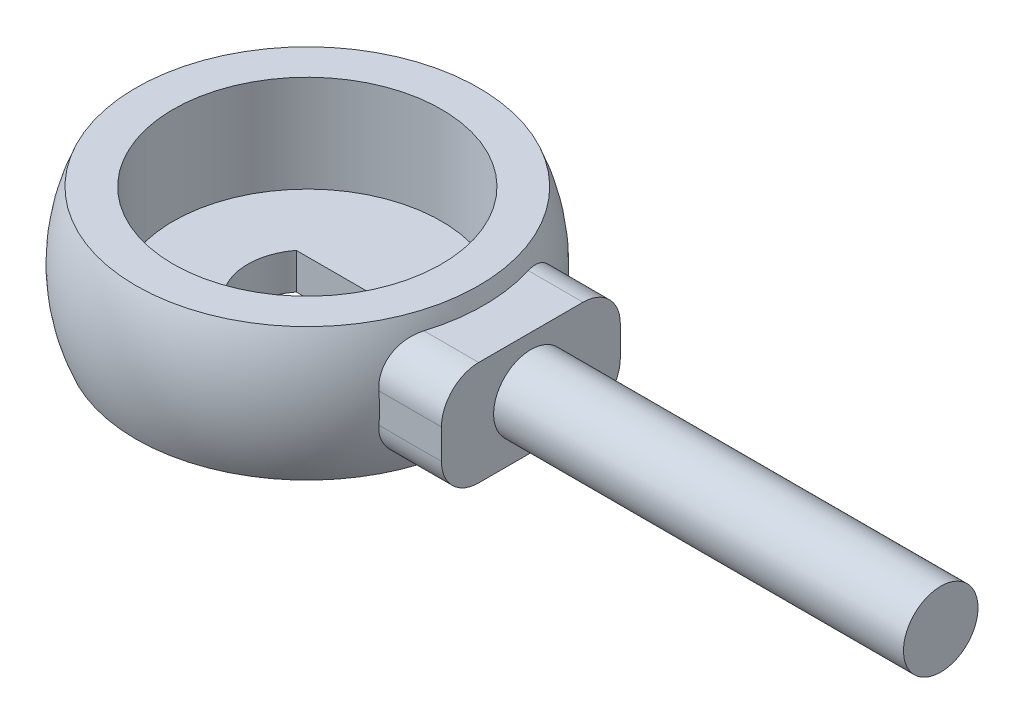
ISO-10303-21;
HEADER;
FILE_DESCRIPTION(('STEP AP214'),'2;1');
FILE_NAME('part.step','',(''),(''),'','','');
FILE_SCHEMA(('AUTOMOTIVE_DESIGN { 1 0 10303 214 1 1 1 1 }'));
ENDSEC;
DATA;
#1=APPLICATION_CONTEXT('core data for automotive mechanical design processes');
#2=APPLICATION_PROTOCOL_DEFINITION('international standard','automotive_design',2000,#1);
#3=PRODUCT_CONTEXT('',#1,'mechanical');
#4=PRODUCT('Part','Part','',(#3));
#5=PRODUCT_RELATED_PRODUCT_CATEGORY('part','',(#4));
#6=PRODUCT_DEFINITION_FORMATION('','',#4);
#7=PRODUCT_DEFINITION_CONTEXT('part definition',#1,'design');
#8=PRODUCT_DEFINITION('design','',#6,#7);
#9=PRODUCT_DEFINITION_SHAPE('','',#8);
#10=(LENGTH_UNIT() NAMED_UNIT(*) SI_UNIT(.MILLI.,.METRE.));
#11=(NAMED_UNIT(*) PLANE_ANGLE_UNIT() SI_UNIT($,.RADIAN.));
#12=(NAMED_UNIT(*) SI_UNIT($,.STERADIAN.) SOLID_ANGLE_UNIT());
#13=UNCERTAINTY_MEASURE_WITH_UNIT(LENGTH_MEASURE(1.E-05),#10,'distance_accuracy_value','');
#14=(GEOMETRIC_REPRESENTATION_CONTEXT(3) GLOBAL_UNCERTAINTY_ASSIGNED_CONTEXT((#13)) GLOBAL_UNIT_ASSIGNED_CONTEXT((#10,
#11,#12)) REPRESENTATION_CONTEXT('',''));
#15=CARTESIAN_POINT('',(0.,0.,0.));
#16=DIRECTION('',(0.,0.,1.));
#17=DIRECTION('',(1.,0.,0.));
#18=AXIS2_PLACEMENT_3D('',#15,#16,#17);
#19=CARTESIAN_POINT('',(0.,8.9196412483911,0.));
#20=DIRECTION('',(0.,-1.,0.));
#21=DIRECTION('',(0.,0.,-1.));
#22=AXIS2_PLACEMENT_3D('',#19,#20,#21);
#23=PLANE('',#22);
#24=CARTESIAN_POINT('',(0.,8.9196412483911,0.));
#25=DIRECTION('',(0.,1.,0.));
#26=DIRECTION('',(0.,0.,1.));
#27=AXIS2_PLACEMENT_3D('',#24,#25,#26);
#28=CIRCLE('',#27,18.);
#29=CARTESIAN_POINT('',(0.,8.9196412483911,18.));
#30=VERTEX_POINT('',#29);
#31=EDGE_CURVE('E185',#30,#30,#28,.T.);
#32=ORIENTED_EDGE('',*,*,#31,.F.);
#33=EDGE_LOOP('',(#32));
#34=FACE_BOUND('',#33,.T.);
#35=CARTESIAN_POINT('',(0.,8.9196412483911,0.));
#36=DIRECTION('',(0.,1.,0.));
#37=DIRECTION('',(0.,0.,1.));
#38=AXIS2_PLACEMENT_3D('',#35,#36,#37);
#39=CIRCLE('',#38,23.);
#40=CARTESIAN_POINT('',(0.,8.9196412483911,23.));
#41=VERTEX_POINT('',#40);
#42=EDGE_CURVE('E307',#41,#41,#39,.T.);
#43=ORIENTED_EDGE('',*,*,#42,.T.);
#44=EDGE_LOOP('',(#43));
#45=FACE_BOUND('',#44,.T.);
#46=ADVANCED_FACE('F32',(#34,#45),#23,.F.);
#47=CARTESIAN_POINT('',(0.,0.,0.));
#48=DIRECTION('',(0.,1.,0.));
#49=DIRECTION('',(0.,0.,1.));
#50=AXIS2_PLACEMENT_3D('',#47,#48,#49);
#51=DEGENERATE_TOROIDAL_SURFACE('',#50,1.8,23.,.T.);
#52=CARTESIAN_POINT('',(0.,-20.6145579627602,12.));
#53=CARTESIAN_POINT('',(-0.664321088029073,-20.6145563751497,12.));
#54=CARTESIAN_POINT('',(-1.3286168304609,-20.5872899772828,12.));
#55=CARTESIAN_POINT('',(-2.65292156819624,-20.4778912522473,12.));
#56=CARTESIAN_POINT('',(-3.31292917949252,-20.3957420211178,12.));
#57=CARTESIAN_POINT('',(-4.62433355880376,-20.1757346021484,12.));
#58=CARTESIAN_POINT('',(-5.27572076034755,-20.0378191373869,12.));
#59=CARTESIAN_POINT('',(-6.56394704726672,-19.7056714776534,12.));
#60=CARTESIAN_POINT('',(-7.20078786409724,-19.5114460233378,12.));
#61=CARTESIAN_POINT('',(-8.45033065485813,-19.0680753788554,12.));
#62=CARTESIAN_POINT('',(-9.06316504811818,-18.8193042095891,12.));
#63=CARTESIAN_POINT('',(-10.2636118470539,-18.2667987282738,12.));
#64=CARTESIAN_POINT('',(-10.8512232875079,-17.9630623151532,12.));
#65=CARTESIAN_POINT('',(-11.9952871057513,-17.3023987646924,12.));
#66=CARTESIAN_POINT('',(-12.5517585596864,-16.9455046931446,12.));
#67=CARTESIAN_POINT('',(-13.6285093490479,-16.1807811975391,12.));
#68=CARTESIAN_POINT('',(-14.1487919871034,-15.7729564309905,12.));
#69=CARTESIAN_POINT('',(-15.1030914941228,-14.9483779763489,12.));
#70=CARTESIAN_POINT('',(-15.5406585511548,-14.5357250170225,12.));
#71=CARTESIAN_POINT('',(-16.3779824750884,-13.6737050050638,12.));
#72=CARTESIAN_POINT('',(-16.7777416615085,-13.2243402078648,12.));
#73=CARTESIAN_POINT('',(-17.5360889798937,-12.2922120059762,12.));
#74=CARTESIAN_POINT('',(-17.8946823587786,-11.8094528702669,12.));
#75=CARTESIAN_POINT('',(-18.5677657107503,-10.8141046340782,12.));
#76=CARTESIAN_POINT('',(-18.882256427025,-10.3015160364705,12.));
#77=CARTESIAN_POINT('',(-19.4523684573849,-9.27235646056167,12.));
#78=CARTESIAN_POINT('',(-19.7098959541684,-8.75684029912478,12.));
#79=CARTESIAN_POINT('',(-20.1800439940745,-7.70573127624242,12.));
#80=CARTESIAN_POINT('',(-20.3926660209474,-7.17013907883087,12.));
#81=CARTESIAN_POINT('',(-20.7713456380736,-6.0828085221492,12.));
#82=CARTESIAN_POINT('',(-20.9374086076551,-5.53107203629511,12.));
#83=CARTESIAN_POINT('',(-21.2217215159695,-4.41541089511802,12.));
#84=CARTESIAN_POINT('',(-21.3399715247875,-3.8514862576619,12.));
#85=CARTESIAN_POINT('',(-21.5264821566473,-2.72322215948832,12.));
#86=CARTESIAN_POINT('',(-21.5953932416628,-2.15899012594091,12.));
#87=CARTESIAN_POINT('',(-21.6852723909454,-1.02672419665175,12.));
#88=CARTESIAN_POINT('',(-21.7062410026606,-0.458690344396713,12.));
#89=CARTESIAN_POINT('',(-21.7000783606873,0.677106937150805,12.));
#90=CARTESIAN_POINT('',(-21.6729478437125,1.24487037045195,12.));
#91=CARTESIAN_POINT('',(-21.5707925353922,2.37607253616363,12.));
#92=CARTESIAN_POINT('',(-21.4957677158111,2.93951126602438,12.));
#93=CARTESIAN_POINT('',(-21.2987232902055,4.05613882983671,12.));
#94=CARTESIAN_POINT('',(-21.1768637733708,4.60935592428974,12.));
#95=CARTESIAN_POINT('',(-20.8870465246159,5.70357700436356,12.));
#96=CARTESIAN_POINT('',(-20.7190889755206,6.24458103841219,12.));
#97=CARTESIAN_POINT('',(-20.3383324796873,7.31055984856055,12.));
#98=CARTESIAN_POINT('',(-20.1255342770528,7.83553489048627,12.));
#99=CARTESIAN_POINT('',(-19.6566814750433,8.86579807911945,12.));
#100=CARTESIAN_POINT('',(-19.4006267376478,9.37108616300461,12.));
#101=CARTESIAN_POINT('',(-18.8463407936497,10.3599563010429,12.));
#102=CARTESIAN_POINT('',(-18.5479859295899,10.8434690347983,12.));
#103=CARTESIAN_POINT('',(-17.9119108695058,11.7838607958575,12.));
#104=CARTESIAN_POINT('',(-17.5741907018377,12.2407398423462,12.));
#105=CARTESIAN_POINT('',(-16.8618981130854,13.1248066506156,12.));
#106=CARTESIAN_POINT('',(-16.4873252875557,13.5519940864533,12.));
#107=CARTESIAN_POINT('',(-15.7041102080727,14.3738959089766,12.));
#108=CARTESIAN_POINT('',(-15.29546767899,14.7686100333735,12.));
#109=CARTESIAN_POINT('',(-14.442019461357,15.5276519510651,12.));
#110=CARTESIAN_POINT('',(-13.9968377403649,15.8915568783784,12.));
#111=CARTESIAN_POINT('',(-13.0780034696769,16.581422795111,12.));
#112=CARTESIAN_POINT('',(-12.6043508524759,16.9073836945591,12.));
#113=CARTESIAN_POINT('',(-11.6321400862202,17.5195763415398,12.));
#114=CARTESIAN_POINT('',(-11.1335853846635,17.8058135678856,12.));
#115=CARTESIAN_POINT('',(-10.1151168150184,18.3373309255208,12.));
#116=CARTESIAN_POINT('',(-9.59520253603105,18.5826102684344,12.));
#117=CARTESIAN_POINT('',(-8.52015218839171,19.0388412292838,12.));
#118=CARTESIAN_POINT('',(-7.96441989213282,19.2483872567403,12.));
#119=CARTESIAN_POINT('',(-6.83806036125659,19.6225584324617,12.));
#120=CARTESIAN_POINT('',(-6.26743286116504,19.7871827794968,12.));
#121=CARTESIAN_POINT('',(-5.11474465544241,20.0717478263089,12.));
#122=CARTESIAN_POINT('',(-4.53267618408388,20.1916569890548,12.));
#123=CARTESIAN_POINT('',(-3.36112343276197,20.3870907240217,12.));
#124=CARTESIAN_POINT('',(-2.77163853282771,20.4626115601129,12.));
#125=CARTESIAN_POINT('',(-1.54033085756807,20.5741495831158,12.));
#126=CARTESIAN_POINT('',(-0.898168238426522,20.6064335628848,12.));
#127=CARTESIAN_POINT('',(0.386713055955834,20.6199857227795,12.));
#128=CARTESIAN_POINT('',(1.02943175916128,20.6012511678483,12.));
#129=CARTESIAN_POINT('',(2.31141657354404,20.5125529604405,12.));
#130=CARTESIAN_POINT('',(2.95068232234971,20.442584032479,12.));
#131=CARTESIAN_POINT('',(4.22141223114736,20.2508051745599,12.));
#132=CARTESIAN_POINT('',(4.85287644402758,20.1289955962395,12.));
#133=CARTESIAN_POINT('',(6.1341151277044,19.8256454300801,12.));
#134=CARTESIAN_POINT('',(6.78326961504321,19.6414693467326,12.));
#135=CARTESIAN_POINT('',(8.0623279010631,19.2151287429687,12.));
#136=CARTESIAN_POINT('',(8.69223084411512,18.9729616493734,12.));
#137=CARTESIAN_POINT('',(9.92657202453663,18.4313489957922,12.));
#138=CARTESIAN_POINT('',(10.5310231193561,18.1319327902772,12.));
#139=CARTESIAN_POINT('',(11.7088652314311,17.4772364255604,12.));
#140=CARTESIAN_POINT('',(12.2822591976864,17.1219615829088,12.));
#141=CARTESIAN_POINT('',(13.3444029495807,16.3908842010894,12.));
#142=CARTESIAN_POINT('',(13.8361893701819,16.0194859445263,12.));
#143=CARTESIAN_POINT('',(14.7848355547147,15.2344814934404,12.));
#144=CARTESIAN_POINT('',(15.2416971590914,14.8208775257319,12.));
#145=CARTESIAN_POINT('',(16.1165022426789,13.9544604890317,12.));
#146=CARTESIAN_POINT('',(16.5344498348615,13.5016515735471,12.));
#147=CARTESIAN_POINT('',(17.3278375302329,12.5602091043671,12.));
#148=CARTESIAN_POINT('',(17.7032790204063,12.0715767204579,12.));
#149=CARTESIAN_POINT('',(18.388262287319,11.0911110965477,12.));
#150=CARTESIAN_POINT('',(18.7003403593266,10.6010474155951,12.));
#151=CARTESIAN_POINT('',(19.2813407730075,9.59598559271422,12.));
#152=CARTESIAN_POINT('',(19.5502650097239,9.08098854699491,12.));
#153=CARTESIAN_POINT('',(20.042814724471,8.02988429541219,12.));
#154=CARTESIAN_POINT('',(20.2664484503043,7.49378095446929,12.));
#155=CARTESIAN_POINT('',(20.6667274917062,6.40430546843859,12.));
#156=CARTESIAN_POINT('',(20.8433729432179,5.85093337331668,12.));
#157=CARTESIAN_POINT('',(21.1454147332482,4.74157686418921,12.));
#158=CARTESIAN_POINT('',(21.2717138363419,4.18583804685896,12.));
#159=CARTESIAN_POINT('',(21.4767893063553,3.06566500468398,12.));
#160=CARTESIAN_POINT('',(21.5555664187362,2.50123091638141,12.));
#161=CARTESIAN_POINT('',(21.6650029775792,1.36772609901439,12.));
#162=CARTESIAN_POINT('',(21.6956631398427,0.798655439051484,12.));
#163=CARTESIAN_POINT('',(21.7086362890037,-0.340037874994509,12.));
#164=CARTESIAN_POINT('',(21.6909492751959,-0.90966052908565,12.));
#165=CARTESIAN_POINT('',(21.607599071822,-2.0421393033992,12.));
#166=CARTESIAN_POINT('',(21.5422080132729,-2.60501547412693,12.));
#167=CARTESIAN_POINT('',(21.3642470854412,-3.72325640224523,12.));
#168=CARTESIAN_POINT('',(21.2516774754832,-4.27862120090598,12.));
#169=CARTESIAN_POINT('',(20.9802029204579,-5.37789781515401,12.));
#170=CARTESIAN_POINT('',(20.8212986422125,-5.9218097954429,12.));
#171=CARTESIAN_POINT('',(20.4583410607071,-6.99435396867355,12.));
#172=CARTESIAN_POINT('',(20.25428765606,-7.52298612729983,12.));
#173=CARTESIAN_POINT('',(19.8023075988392,-8.56183552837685,12.));
#174=CARTESIAN_POINT('',(19.5543331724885,-9.07203198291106,12.));
#175=CARTESIAN_POINT('',(19.0165161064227,-10.0698529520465,12.));
#176=CARTESIAN_POINT('',(18.7266735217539,-10.5574774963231,12.));
#177=CARTESIAN_POINT('',(18.1072950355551,-11.5067927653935,12.));
#178=CARTESIAN_POINT('',(17.7777609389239,-11.9684846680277,12.));
#179=CARTESIAN_POINT('',(17.0814389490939,-12.8628587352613,12.));
#180=CARTESIAN_POINT('',(16.7146508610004,-13.2955407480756,12.));
#181=CARTESIAN_POINT('',(15.9432605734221,-14.1326246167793,12.));
#182=CARTESIAN_POINT('',(15.5383626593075,-14.5367539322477,12.));
#183=CARTESIAN_POINT('',(14.6964708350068,-15.3100568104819,12.));
#184=CARTESIAN_POINT('',(14.2594767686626,-15.6792302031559,12.));
#185=CARTESIAN_POINT('',(13.3565547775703,-16.3804766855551,12.));
#186=CARTESIAN_POINT('',(12.8906214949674,-16.7125428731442,12.));
#187=CARTESIAN_POINT('',(11.9333188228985,-17.3376891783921,12.));
#188=CARTESIAN_POINT('',(11.4419494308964,-17.6307692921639,12.));
#189=CARTESIAN_POINT('',(10.4247658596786,-18.1833980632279,12.));
#190=CARTESIAN_POINT('',(9.89839813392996,-18.4419275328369,12.));
#191=CARTESIAN_POINT('',(8.82650391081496,-18.9156606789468,12.));
#192=CARTESIAN_POINT('',(8.28097608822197,-19.1308613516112,12.));
#193=CARTESIAN_POINT('',(7.17506956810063,-19.5173439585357,12.));
#194=CARTESIAN_POINT('',(6.61470256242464,-19.6886593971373,12.));
#195=CARTESIAN_POINT('',(5.48260568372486,-19.9876023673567,12.));
#196=CARTESIAN_POINT('',(4.91087796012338,-20.1152380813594,12.));
#197=CARTESIAN_POINT('',(3.6207881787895,-20.3527963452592,12.));
#198=CARTESIAN_POINT('',(2.90025827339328,-20.4510586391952,12.));
#199=CARTESIAN_POINT('',(1.45314315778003,-20.5819488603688,12.));
#200=CARTESIAN_POINT('',(0.726556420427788,-20.6145596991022,12.));
#201=CARTESIAN_POINT('',(0.,-20.6145579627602,12.));
#202=B_SPLINE_CURVE_WITH_KNOTS('',3,(#52,#53,#54,#55,#56,#57,#58,#59,#60,#61,#62,#63,#64,#65,
#66,#67,#68,#69,#70,#71,#72,#73,#74,#75,#76,#77,#78,#79,#80,#81,#82,#83,#84,#85,#86,#87,#88,#89,
#90,#91,#92,#93,#94,#95,#96,#97,#98,#99,#100,#101,#102,#103,#104,#105,#106,#107,#108,#109,#110,
#111,#112,#113,#114,#115,#116,#117,#118,#119,#120,#121,#122,#123,#124,#125,#126,#127,#128,#129,
#130,#131,#132,#133,#134,#135,#136,#137,#138,#139,#140,#141,#142,#143,#144,#145,#146,#147,#148,
#149,#150,#151,#152,#153,#154,#155,#156,#157,#158,#159,#160,#161,#162,#163,#164,#165,#166,#167,
#168,#169,#170,#171,#172,#173,#174,#175,#176,#177,#178,#179,#180,#181,#182,#183,#184,#185,#186,
#187,#188,#189,#190,#191,#192,#193,#194,#195,#196,#197,#198,#199,#200,#201),.UNSPECIFIED.,.T.,
.F.,(4,2,2,2,2,2,2,2,2,2,2,2,2,2,2,2,2,2,2,2,2,2,2,2,2,2,2,2,2,2,2,2,2,2,2,2,2,2,2,2,2,2,2,2,2,
2,2,2,2,2,2,2,2,2,2,2,2,2,2,2,2,2,2,2,2,2,2,2,2,2,2,2,2,2,4),(0.,1.99235367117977,
3.98532127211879,5.98034105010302,7.9751221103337,9.95663040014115,11.9382144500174,
13.9185709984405,15.8987465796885,17.7008568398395,19.5028564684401,21.3046261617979,
23.1063654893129,24.8330719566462,26.5597213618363,28.2861711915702,30.0126184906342,
31.7158636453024,33.4190893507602,35.1222889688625,36.8254895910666,38.5229194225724,
40.2203425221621,41.9177374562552,43.6151378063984,45.3176066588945,47.0200742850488,
48.7225605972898,50.4250606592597,52.1480501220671,53.871043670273,55.5937993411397,
57.3165881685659,59.0964221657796,60.8762879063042,62.6574065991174,64.4386751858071,
66.3655306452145,68.2924894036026,70.2196466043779,72.1467907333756,74.1684109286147,
76.1901208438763,78.2107968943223,80.2312807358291,82.0777237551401,83.9240694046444,
85.7702196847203,87.6163097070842,89.3571869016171,91.0979876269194,92.838471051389,
94.5789494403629,96.2866399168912,97.9943036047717,99.701941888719,101.409580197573,
103.107552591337,104.805515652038,106.503454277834,108.20139671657,109.901197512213,
111.600996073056,113.300717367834,115.000447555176,116.714668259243,118.428897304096,
120.14344467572,121.857992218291,123.615322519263,125.372774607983,127.128880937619,
128.884658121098,131.063093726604,133.242096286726),.UNSPECIFIED.);
#203=CARTESIAN_POINT('',(21.6038506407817,2.,12.));
#204=VERTEX_POINT('',#203);
#205=CARTESIAN_POINT('',(21.6038506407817,-2.,12.));
#206=VERTEX_POINT('',#205);
#207=EDGE_CURVE('E181',#204,#206,#202,.T.);
#208=ORIENTED_EDGE('',*,*,#207,.F.);
#209=CARTESIAN_POINT('',(21.6038506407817,2.,12.));
#210=CARTESIAN_POINT('',(21.5905000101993,2.13365566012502,12.0000170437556));
#211=CARTESIAN_POINT('',(21.5787690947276,2.2674771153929,11.9946414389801));
#212=CARTESIAN_POINT('',(21.5586444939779,2.53450910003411,11.973147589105));
#213=CARTESIAN_POINT('',(21.550250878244,2.66771961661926,11.9570291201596));
#214=CARTESIAN_POINT('',(21.5369059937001,2.93244761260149,11.9141139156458));
#215=CARTESIAN_POINT('',(21.5319512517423,3.0639666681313,11.8873279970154));
#216=CARTESIAN_POINT('',(21.5255295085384,3.32450041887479,11.8232448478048));
#217=CARTESIAN_POINT('',(21.5240623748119,3.45351520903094,11.7859480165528));
#218=CARTESIAN_POINT('',(21.5246434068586,3.70819998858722,11.7010724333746));
#219=CARTESIAN_POINT('',(21.5266937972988,3.8338678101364,11.6534871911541));
#220=CARTESIAN_POINT('',(21.5343084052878,4.08092251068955,11.5483830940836));
#221=CARTESIAN_POINT('',(21.5398739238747,4.20230778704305,11.4908605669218));
#222=CARTESIAN_POINT('',(21.554474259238,4.43982662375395,11.3663730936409));
#223=CARTESIAN_POINT('',(21.5635070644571,4.55596318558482,11.2994136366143));
#224=CARTESIAN_POINT('',(21.5849714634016,4.78230744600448,11.1565231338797));
#225=CARTESIAN_POINT('',(21.5974043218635,4.8925129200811,11.0805887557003));
#226=CARTESIAN_POINT('',(21.6255526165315,5.10615364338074,10.9204111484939));
#227=CARTESIAN_POINT('',(21.6412660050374,5.20959306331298,10.8361731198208));
#228=CARTESIAN_POINT('',(21.6758522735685,5.40916010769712,10.6599663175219));
#229=CARTESIAN_POINT('',(21.6947262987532,5.50528506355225,10.5679947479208));
#230=CARTESIAN_POINT('',(21.7354666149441,5.68958578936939,10.3770634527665));
#231=CARTESIAN_POINT('',(21.7573322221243,5.77776336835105,10.2781053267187));
#232=CARTESIAN_POINT('',(21.8038870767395,5.94572944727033,10.0738753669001));
#233=CARTESIAN_POINT('',(21.8285773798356,6.02551478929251,9.96860117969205));
#234=CARTESIAN_POINT('',(21.8813243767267,6.17839904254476,9.74942396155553));
#235=CARTESIAN_POINT('',(21.9094570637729,6.25124197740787,9.6353603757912));
#236=CARTESIAN_POINT('',(21.9682683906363,6.38721971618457,9.40219653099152));
#237=CARTESIAN_POINT('',(21.9989479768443,6.45035088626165,9.28309440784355));
#238=CARTESIAN_POINT('',(22.0944538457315,6.62468746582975,8.91947585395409));
#239=CARTESIAN_POINT('',(22.1627815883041,6.72093467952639,8.66850485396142));
#240=CARTESIAN_POINT('',(22.2994696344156,6.86422845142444,8.18199266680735));
#241=CARTESIAN_POINT('',(22.3671498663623,6.91521841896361,7.94740182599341));
#242=CARTESIAN_POINT('',(22.4718483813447,6.96612949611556,7.5931184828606));
#243=CARTESIAN_POINT('',(22.5072612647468,6.97883756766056,7.47467727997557));
#244=CARTESIAN_POINT('',(22.5789862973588,6.99577298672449,7.23746335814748));
#245=CARTESIAN_POINT('',(22.6152984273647,7.00000051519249,7.11869064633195));
#246=CARTESIAN_POINT('',(22.6519766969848,7.,7.));
#247=B_SPLINE_CURVE_WITH_KNOTS('',3,(#209,#210,#211,#212,#213,#214,#215,#216,#217,#218,#219,
#220,#221,#222,#223,#224,#225,#226,#227,#228,#229,#230,#231,#232,#233,#234,#235,#236,#237,#238,
#239,#240,#241,#242,#243,#244,#245,#246),.UNSPECIFIED.,.F.,.F.,(4,2,2,2,2,2,2,2,2,2,2,2,2,2,2,2,
2,2,4),(0.,0.402850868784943,0.805710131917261,1.20816192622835,1.610598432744,2.01328955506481,
2.41612981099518,2.81873671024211,3.22149357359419,3.62399978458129,4.02665214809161,
4.42921262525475,4.831924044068,5.24613450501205,5.66049957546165,6.48870592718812,
7.2344832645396,7.60704349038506,7.97959576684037),.UNSPECIFIED.);
#248=CARTESIAN_POINT('',(22.6519766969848,7.,7.));
#249=VERTEX_POINT('',#248);
#250=EDGE_CURVE('E11',#204,#249,#247,.T.);
#251=ORIENTED_EDGE('',*,*,#250,.T.);
#252=CARTESIAN_POINT('',(0.,7.,0.));
#253=DIRECTION('',(0.,1.,0.));
#254=DIRECTION('',(0.,0.,1.));
#255=AXIS2_PLACEMENT_3D('',#252,#253,#254);
#256=CIRCLE('',#255,23.7089023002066);
#257=CARTESIAN_POINT('',(22.6519766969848,7.,-7.));
#258=VERTEX_POINT('',#257);
#259=EDGE_CURVE('E199',#258,#249,#256,.F.);
#260=ORIENTED_EDGE('',*,*,#259,.F.);
#261=CARTESIAN_POINT('',(22.6519766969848,7.,-7.));
#262=CARTESIAN_POINT('',(22.6080184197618,7.00001125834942,-7.14224541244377));
#263=CARTESIAN_POINT('',(22.5645728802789,6.9939301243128,-7.28465730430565));
#264=CARTESIAN_POINT('',(22.4790209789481,6.96957834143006,-7.5688642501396));
#265=CARTESIAN_POINT('',(22.4369148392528,6.95130568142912,-7.7106591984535));
#266=CARTESIAN_POINT('',(22.3543130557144,6.90253239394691,-7.99282993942));
#267=CARTESIAN_POINT('',(22.3138197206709,6.8720148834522,-8.13320349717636));
#268=CARTESIAN_POINT('',(22.2348298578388,6.79883901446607,-8.41131706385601));
#269=CARTESIAN_POINT('',(22.1963332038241,6.75618142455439,-8.54905723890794));
#270=CARTESIAN_POINT('',(22.1215992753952,6.65881392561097,-8.82108557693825));
#271=CARTESIAN_POINT('',(22.085365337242,6.60408673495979,-8.95536847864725));
#272=CARTESIAN_POINT('',(22.0155200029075,6.4828447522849,-9.21927835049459));
#273=CARTESIAN_POINT('',(21.9819095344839,6.4163258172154,-9.34890366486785));
#274=CARTESIAN_POINT('',(21.9176626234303,6.27193474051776,-9.60227079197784));
#275=CARTESIAN_POINT('',(21.8870232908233,6.19407381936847,-9.72601826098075));
#276=CARTESIAN_POINT('',(21.8289729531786,6.02741066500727,-9.96671332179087));
#277=CARTESIAN_POINT('',(21.8015617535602,5.93860909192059,-10.0836613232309));
#278=CARTESIAN_POINT('',(21.7511756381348,5.75407784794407,-10.3055950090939));
#279=CARTESIAN_POINT('',(21.7280751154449,5.65872046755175,-10.4108617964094));
#280=CARTESIAN_POINT('',(21.685345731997,5.45903782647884,-10.6132051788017));
#281=CARTESIAN_POINT('',(21.6657154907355,5.35471615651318,-10.7102850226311));
#282=CARTESIAN_POINT('',(21.6301016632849,5.13777149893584,-10.8954762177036));
#283=CARTESIAN_POINT('',(21.614118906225,5.0251466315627,-10.9835855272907));
#284=CARTESIAN_POINT('',(21.5859628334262,4.79244481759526,-11.1500255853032));
#285=CARTESIAN_POINT('',(21.5737893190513,4.67236825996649,-11.2283568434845));
#286=CARTESIAN_POINT('',(21.5538456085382,4.4314406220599,-11.3711303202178));
#287=CARTESIAN_POINT('',(21.5458964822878,4.31088701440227,-11.4360500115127));
#288=CARTESIAN_POINT('',(21.533633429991,4.06471375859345,-11.5558417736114));
#289=CARTESIAN_POINT('',(21.529319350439,3.9390943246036,-11.6107142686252));
#290=CARTESIAN_POINT('',(21.5243580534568,3.68377236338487,-11.7099529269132));
#291=CARTESIAN_POINT('',(21.5237089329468,3.55407199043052,-11.7543245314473));
#292=CARTESIAN_POINT('',(21.5260630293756,3.29154843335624,-11.8322517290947));
#293=CARTESIAN_POINT('',(21.5290652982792,3.15872606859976,-11.8658101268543));
#294=CARTESIAN_POINT('',(21.5399346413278,2.85597966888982,-11.9291995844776));
#295=CARTESIAN_POINT('',(21.5488644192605,2.68539581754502,-11.9557878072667));
#296=CARTESIAN_POINT('',(21.5664186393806,2.42865162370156,-11.9823353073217));
#297=CARTESIAN_POINT('',(21.5729582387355,2.34297613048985,-11.9889620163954));
#298=CARTESIAN_POINT('',(21.5873940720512,2.17151794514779,-11.9977940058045));
#299=CARTESIAN_POINT('',(21.5952902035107,2.08573526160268,-11.999999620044));
#300=CARTESIAN_POINT('',(21.6038506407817,2.,-12.));
#301=B_SPLINE_CURVE_WITH_KNOTS('',3,(#261,#262,#263,#264,#265,#266,#267,#268,#269,#270,#271,
#272,#273,#274,#275,#276,#277,#278,#279,#280,#281,#282,#283,#284,#285,#286,#287,#288,#289,#290,
#291,#292,#293,#294,#295,#296,#297,#298,#299,#300),.UNSPECIFIED.,.F.,.F.,(4,2,2,2,2,2,2,2,2,2,2,
2,2,2,2,2,2,2,2,4),(0.,0.446534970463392,0.89314362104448,1.34037017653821,1.78756842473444,
2.23541119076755,2.68341161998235,3.13097182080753,3.57850503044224,4.00966628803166,
4.44065563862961,4.87174286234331,5.30280760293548,5.71376217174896,6.12469938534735,
6.53542319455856,6.94604038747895,7.46351847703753,7.72195372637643,7.980369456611),.UNSPECIFIED.);
#302=CARTESIAN_POINT('',(21.6038506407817,2.,-12.));
#303=VERTEX_POINT('',#302);
#304=EDGE_CURVE('E261',#258,#303,#301,.T.);
#305=ORIENTED_EDGE('',*,*,#304,.T.);
#306=CARTESIAN_POINT('',(0.,20.6145579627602,-12.));
#307=CARTESIAN_POINT('',(-0.664321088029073,20.6145563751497,-12.));
#308=CARTESIAN_POINT('',(-1.3286168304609,20.5872899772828,-12.));
#309=CARTESIAN_POINT('',(-2.65292156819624,20.4778912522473,-12.));
#310=CARTESIAN_POINT('',(-3.31292917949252,20.3957420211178,-12.));
#311=CARTESIAN_POINT('',(-4.62433355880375,20.1757346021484,-12.));
#312=CARTESIAN_POINT('',(-5.27572076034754,20.0378191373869,-12.));
#313=CARTESIAN_POINT('',(-6.56394704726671,19.7056714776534,-12.));
#314=CARTESIAN_POINT('',(-7.20078786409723,19.5114460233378,-12.));
#315=CARTESIAN_POINT('',(-8.45033065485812,19.0680753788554,-12.));
#316=CARTESIAN_POINT('',(-9.06316504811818,18.8193042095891,-12.));
#317=CARTESIAN_POINT('',(-10.2636118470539,18.2667987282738,-12.));
#318=CARTESIAN_POINT('',(-10.8512232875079,17.9630623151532,-12.));
#319=CARTESIAN_POINT('',(-11.9952871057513,17.3023987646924,-12.));
#320=CARTESIAN_POINT('',(-12.5517585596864,16.9455046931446,-12.));
#321=CARTESIAN_POINT('',(-13.6285093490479,16.1807811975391,-12.));
#322=CARTESIAN_POINT('',(-14.1487919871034,15.7729564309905,-12.));
#323=CARTESIAN_POINT('',(-15.1030914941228,14.9483779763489,-12.));
#324=CARTESIAN_POINT('',(-15.5406585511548,14.5357250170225,-12.));
#325=CARTESIAN_POINT('',(-16.3779824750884,13.6737050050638,-12.));
#326=CARTESIAN_POINT('',(-16.7777416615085,13.2243402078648,-12.));
#327=CARTESIAN_POINT('',(-17.5360889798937,12.2922120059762,-12.));
#328=CARTESIAN_POINT('',(-17.8946823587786,11.8094528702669,-12.));
#329=CARTESIAN_POINT('',(-18.5677657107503,10.8141046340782,-12.));
#330=CARTESIAN_POINT('',(-18.882256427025,10.3015160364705,-12.));
#331=CARTESIAN_POINT('',(-19.4523684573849,9.27235646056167,-12.));
#332=CARTESIAN_POINT('',(-19.7098959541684,8.75684029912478,-12.));
#333=CARTESIAN_POINT('',(-20.1800439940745,7.70573127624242,-12.));
#334=CARTESIAN_POINT('',(-20.3926660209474,7.17013907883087,-12.));
#335=CARTESIAN_POINT('',(-20.7713456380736,6.0828085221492,-12.));
#336=CARTESIAN_POINT('',(-20.9374086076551,5.53107203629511,-12.));
#337=CARTESIAN_POINT('',(-21.2217215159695,4.41541089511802,-12.));
#338=CARTESIAN_POINT('',(-21.3399715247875,3.8514862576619,-12.));
#339=CARTESIAN_POINT('',(-21.5264821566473,2.72322215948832,-12.));
#340=CARTESIAN_POINT('',(-21.5953932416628,2.15899012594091,-12.));
#341=CARTESIAN_POINT('',(-21.6852723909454,1.02672419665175,-12.));
#342=CARTESIAN_POINT('',(-21.7062410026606,0.458690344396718,-12.));
#343=CARTESIAN_POINT('',(-21.7000783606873,-0.677106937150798,-12.));
#344=CARTESIAN_POINT('',(-21.6729478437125,-1.24487037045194,-12.));
#345=CARTESIAN_POINT('',(-21.5707925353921,-2.37607253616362,-12.));
#346=CARTESIAN_POINT('',(-21.4957677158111,-2.93951126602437,-12.));
#347=CARTESIAN_POINT('',(-21.2987232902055,-4.0561388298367,-12.));
#348=CARTESIAN_POINT('',(-21.1768637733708,-4.60935592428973,-12.));
#349=CARTESIAN_POINT('',(-20.8870465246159,-5.70357700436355,-12.));
#350=CARTESIAN_POINT('',(-20.7190889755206,-6.24458103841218,-12.));
#351=CARTESIAN_POINT('',(-20.3383324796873,-7.31055984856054,-12.));
#352=CARTESIAN_POINT('',(-20.1255342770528,-7.83553489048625,-12.));
#353=CARTESIAN_POINT('',(-19.6566814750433,-8.86579807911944,-12.));
#354=CARTESIAN_POINT('',(-19.4006267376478,-9.3710861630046,-12.));
#355=CARTESIAN_POINT('',(-18.8463407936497,-10.3599563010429,-12.));
#356=CARTESIAN_POINT('',(-18.5479859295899,-10.8434690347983,-12.));
#357=CARTESIAN_POINT('',(-17.9119108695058,-11.7838607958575,-12.));
#358=CARTESIAN_POINT('',(-17.5741907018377,-12.2407398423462,-12.));
#359=CARTESIAN_POINT('',(-16.8618981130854,-13.1248066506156,-12.));
#360=CARTESIAN_POINT('',(-16.4873252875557,-13.5519940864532,-12.));
#361=CARTESIAN_POINT('',(-15.7041102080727,-14.3738959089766,-12.));
#362=CARTESIAN_POINT('',(-15.29546767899,-14.7686100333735,-12.));
#363=CARTESIAN_POINT('',(-14.442019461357,-15.5276519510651,-12.));
#364=CARTESIAN_POINT('',(-13.9968377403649,-15.8915568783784,-12.));
#365=CARTESIAN_POINT('',(-13.0780034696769,-16.581422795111,-12.));
#366=CARTESIAN_POINT('',(-12.604350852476,-16.9073836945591,-12.));
#367=CARTESIAN_POINT('',(-11.6321400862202,-17.5195763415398,-12.));
#368=CARTESIAN_POINT('',(-11.1335853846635,-17.8058135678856,-12.));
#369=CARTESIAN_POINT('',(-10.1151168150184,-18.3373309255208,-12.));
#370=CARTESIAN_POINT('',(-9.59520253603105,-18.5826102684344,-12.));
#371=CARTESIAN_POINT('',(-8.52015218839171,-19.0388412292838,-12.));
#372=CARTESIAN_POINT('',(-7.96441989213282,-19.2483872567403,-12.));
#373=CARTESIAN_POINT('',(-6.83806036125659,-19.6225584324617,-12.));
#374=CARTESIAN_POINT('',(-6.26743286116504,-19.7871827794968,-12.));
#375=CARTESIAN_POINT('',(-5.11474465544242,-20.0717478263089,-12.));
#376=CARTESIAN_POINT('',(-4.53267618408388,-20.1916569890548,-12.));
#377=CARTESIAN_POINT('',(-3.36112343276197,-20.3870907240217,-12.));
#378=CARTESIAN_POINT('',(-2.77163853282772,-20.4626115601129,-12.));
#379=CARTESIAN_POINT('',(-1.54033085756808,-20.5741495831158,-12.));
#380=CARTESIAN_POINT('',(-0.898168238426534,-20.6064335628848,-12.));
#381=CARTESIAN_POINT('',(0.386713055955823,-20.6199857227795,-12.));
#382=CARTESIAN_POINT('',(1.02943175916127,-20.6012511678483,-12.));
#383=CARTESIAN_POINT('',(2.31141657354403,-20.5125529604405,-12.));
#384=CARTESIAN_POINT('',(2.95068232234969,-20.442584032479,-12.));
#385=CARTESIAN_POINT('',(4.22141223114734,-20.2508051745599,-12.));
#386=CARTESIAN_POINT('',(4.85287644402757,-20.1289955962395,-12.));
#387=CARTESIAN_POINT('',(6.13411512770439,-19.8256454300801,-12.));
#388=CARTESIAN_POINT('',(6.7832696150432,-19.6414693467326,-12.));
#389=CARTESIAN_POINT('',(8.06232790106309,-19.2151287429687,-12.));
#390=CARTESIAN_POINT('',(8.69223084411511,-18.9729616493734,-12.));
#391=CARTESIAN_POINT('',(9.92657202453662,-18.4313489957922,-12.));
#392=CARTESIAN_POINT('',(10.5310231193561,-18.1319327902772,-12.));
#393=CARTESIAN_POINT('',(11.7088652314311,-17.4772364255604,-12.));
#394=CARTESIAN_POINT('',(12.2822591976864,-17.1219615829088,-12.));
#395=CARTESIAN_POINT('',(13.3444029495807,-16.3908842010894,-12.));
#396=CARTESIAN_POINT('',(13.8361893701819,-16.0194859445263,-12.));
#397=CARTESIAN_POINT('',(14.7848355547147,-15.2344814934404,-12.));
#398=CARTESIAN_POINT('',(15.2416971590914,-14.8208775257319,-12.));
#399=CARTESIAN_POINT('',(16.1165022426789,-13.9544604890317,-12.));
#400=CARTESIAN_POINT('',(16.5344498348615,-13.5016515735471,-12.));
#401=CARTESIAN_POINT('',(17.3278375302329,-12.5602091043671,-12.));
#402=CARTESIAN_POINT('',(17.7032790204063,-12.0715767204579,-12.));
#403=CARTESIAN_POINT('',(18.3882622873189,-11.0911110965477,-12.));
#404=CARTESIAN_POINT('',(18.7003403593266,-10.6010474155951,-12.));
#405=CARTESIAN_POINT('',(19.2813407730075,-9.59598559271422,-12.));
#406=CARTESIAN_POINT('',(19.5502650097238,-9.08098854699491,-12.));
#407=CARTESIAN_POINT('',(20.042814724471,-8.0298842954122,-12.));
#408=CARTESIAN_POINT('',(20.2664484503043,-7.4937809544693,-12.));
#409=CARTESIAN_POINT('',(20.6667274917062,-6.4043054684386,-12.));
#410=CARTESIAN_POINT('',(20.8433729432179,-5.85093337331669,-12.));
#411=CARTESIAN_POINT('',(21.1454147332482,-4.74157686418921,-12.));
#412=CARTESIAN_POINT('',(21.2717138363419,-4.18583804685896,-12.));
#413=CARTESIAN_POINT('',(21.4767893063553,-3.06566500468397,-12.));
#414=CARTESIAN_POINT('',(21.5555664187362,-2.50123091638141,-12.));
#415=CARTESIAN_POINT('',(21.6650029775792,-1.36772609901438,-12.));
#416=CARTESIAN_POINT('',(21.6956631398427,-0.798655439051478,-12.));
#417=CARTESIAN_POINT('',(21.7086362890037,0.34003787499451,-12.));
#418=CARTESIAN_POINT('',(21.6909492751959,0.909660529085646,-12.));
#419=CARTESIAN_POINT('',(21.607599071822,2.04213930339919,-12.));
#420=CARTESIAN_POINT('',(21.5422080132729,2.60501547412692,-12.));
#421=CARTESIAN_POINT('',(21.3642470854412,3.72325640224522,-12.));
#422=CARTESIAN_POINT('',(21.2516774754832,4.27862120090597,-12.));
#423=CARTESIAN_POINT('',(20.9802029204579,5.377897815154,-12.));
#424=CARTESIAN_POINT('',(20.8212986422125,5.9218097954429,-12.));
#425=CARTESIAN_POINT('',(20.4583410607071,6.99435396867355,-12.));
#426=CARTESIAN_POINT('',(20.25428765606,7.52298612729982,-12.));
#427=CARTESIAN_POINT('',(19.8023075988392,8.56183552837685,-12.));
#428=CARTESIAN_POINT('',(19.5543331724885,9.07203198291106,-12.));
#429=CARTESIAN_POINT('',(19.0165161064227,10.0698529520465,-12.));
#430=CARTESIAN_POINT('',(18.7266735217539,10.5574774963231,-12.));
#431=CARTESIAN_POINT('',(18.1072950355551,11.5067927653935,-12.));
#432=CARTESIAN_POINT('',(17.7777609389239,11.9684846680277,-12.));
#433=CARTESIAN_POINT('',(17.0814389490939,12.8628587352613,-12.));
#434=CARTESIAN_POINT('',(16.7146508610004,13.2955407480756,-12.));
#435=CARTESIAN_POINT('',(15.9432605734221,14.1326246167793,-12.));
#436=CARTESIAN_POINT('',(15.5383626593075,14.5367539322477,-12.));
#437=CARTESIAN_POINT('',(14.6964708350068,15.3100568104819,-12.));
#438=CARTESIAN_POINT('',(14.2594767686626,15.6792302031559,-12.));
#439=CARTESIAN_POINT('',(13.3565547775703,16.3804766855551,-12.));
#440=CARTESIAN_POINT('',(12.8906214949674,16.7125428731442,-12.));
#441=CARTESIAN_POINT('',(11.9333188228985,17.3376891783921,-12.));
#442=CARTESIAN_POINT('',(11.4419494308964,17.6307692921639,-12.));
#443=CARTESIAN_POINT('',(10.4247658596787,18.1833980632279,-12.));
#444=CARTESIAN_POINT('',(9.89839813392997,18.4419275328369,-12.));
#445=CARTESIAN_POINT('',(8.82650391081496,18.9156606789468,-12.));
#446=CARTESIAN_POINT('',(8.28097608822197,19.1308613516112,-12.));
#447=CARTESIAN_POINT('',(7.17506956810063,19.5173439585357,-12.));
#448=CARTESIAN_POINT('',(6.61470256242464,19.6886593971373,-12.));
#449=CARTESIAN_POINT('',(5.48260568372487,19.9876023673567,-12.));
#450=CARTESIAN_POINT('',(4.9108779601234,20.1152380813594,-12.));
#451=CARTESIAN_POINT('',(3.62078817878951,20.3527963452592,-12.));
#452=CARTESIAN_POINT('',(2.90025827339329,20.4510586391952,-12.));
#453=CARTESIAN_POINT('',(1.45314315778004,20.5819488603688,-12.));
#454=CARTESIAN_POINT('',(0.72655642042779,20.6145596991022,-12.));
#455=CARTESIAN_POINT('',(0.,20.6145579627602,-12.));
#456=B_SPLINE_CURVE_WITH_KNOTS('',3,(#306,#307,#308,#309,#310,#311,#312,#313,#314,#315,#316,
#317,#318,#319,#320,#321,#322,#323,#324,#325,#326,#327,#328,#329,#330,#331,#332,#333,#334,#335,
#336,#337,#338,#339,#340,#341,#342,#343,#344,#345,#346,#347,#348,#349,#350,#351,#352,#353,#354,
#355,#356,#357,#358,#359,#360,#361,#362,#363,#364,#365,#366,#367,#368,#369,#370,#371,#372,#373,
#374,#375,#376,#377,#378,#379,#380,#381,#382,#383,#384,#385,#386,#387,#388,#389,#390,#391,#392,
#393,#394,#395,#396,#397,#398,#399,#400,#401,#402,#403,#404,#405,#406,#407,#408,#409,#410,#411,
#412,#413,#414,#415,#416,#417,#418,#419,#420,#421,#422,#423,#424,#425,#426,#427,#428,#429,#430,
#431,#432,#433,#434,#435,#436,#437,#438,#439,#440,#441,#442,#443,#444,#445,#446,#447,#448,#449,
#450,#451,#452,#453,#454,#455),.UNSPECIFIED.,.T.,.F.,(4,2,2,2,2,2,2,2,2,2,2,2,2,2,2,2,2,2,2,2,2,
2,2,2,2,2,2,2,2,2,2,2,2,2,2,2,2,2,2,2,2,2,2,2,2,2,2,2,2,2,2,2,2,2,2,2,2,2,2,2,2,2,2,2,2,2,2,2,2,
2,2,2,2,2,4),(0.,1.99235367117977,3.98532127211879,5.98034105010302,7.9751221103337,
9.95663040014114,11.9382144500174,13.9185709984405,15.8987465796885,17.7008568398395,
19.5028564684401,21.3046261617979,23.1063654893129,24.8330719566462,26.5597213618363,
28.2861711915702,30.0126184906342,31.7158636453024,33.4190893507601,35.1222889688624,
36.8254895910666,38.5229194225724,40.2203425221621,41.9177374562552,43.6151378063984,
45.3176066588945,47.0200742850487,48.7225605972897,50.4250606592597,52.1480501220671,
53.871043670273,55.5937993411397,57.3165881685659,59.0964221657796,60.8762879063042,
62.6574065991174,64.4386751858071,66.3655306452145,68.2924894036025,70.2196466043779,
72.1467907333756,74.1684109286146,76.1901208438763,78.2107968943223,80.2312807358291,
82.0777237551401,83.9240694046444,85.7702196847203,87.6163097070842,89.3571869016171,
91.0979876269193,92.838471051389,94.5789494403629,96.2866399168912,97.9943036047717,
99.701941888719,101.409580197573,103.107552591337,104.805515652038,106.503454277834,
108.20139671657,109.901197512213,111.600996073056,113.300717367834,115.000447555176,
116.714668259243,118.428897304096,120.14344467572,121.857992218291,123.615322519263,
125.372774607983,127.128880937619,128.884658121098,131.063093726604,133.242096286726),.UNSPECIFIED.);
#457=CARTESIAN_POINT('',(21.6038506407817,-1.99999999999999,-12.));
#458=VERTEX_POINT('',#457);
#459=EDGE_CURVE('E174',#458,#303,#456,.T.);
#460=ORIENTED_EDGE('',*,*,#459,.F.);
#461=CARTESIAN_POINT('',(21.6038506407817,-2.,-12.));
#462=CARTESIAN_POINT('',(21.5905000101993,-2.13365566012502,-12.0000170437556));
#463=CARTESIAN_POINT('',(21.5787690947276,-2.2674771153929,-11.9946414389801));
#464=CARTESIAN_POINT('',(21.5586444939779,-2.53450910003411,-11.973147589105));
#465=CARTESIAN_POINT('',(21.550250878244,-2.66771961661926,-11.9570291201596));
#466=CARTESIAN_POINT('',(21.5369059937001,-2.93244761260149,-11.9141139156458));
#467=CARTESIAN_POINT('',(21.5319512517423,-3.0639666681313,-11.8873279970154));
#468=CARTESIAN_POINT('',(21.5255295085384,-3.32450041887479,-11.8232448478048));
#469=CARTESIAN_POINT('',(21.5240623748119,-3.45351520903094,-11.7859480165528));
#470=CARTESIAN_POINT('',(21.5246434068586,-3.70819998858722,-11.7010724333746));
#471=CARTESIAN_POINT('',(21.5266937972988,-3.8338678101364,-11.6534871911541));
#472=CARTESIAN_POINT('',(21.5343084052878,-4.08092251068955,-11.5483830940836));
#473=CARTESIAN_POINT('',(21.5398739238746,-4.20230778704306,-11.4908605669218));
#474=CARTESIAN_POINT('',(21.554474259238,-4.43982662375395,-11.3663730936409));
#475=CARTESIAN_POINT('',(21.5635070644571,-4.55596318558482,-11.2994136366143));
#476=CARTESIAN_POINT('',(21.5849714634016,-4.78230744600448,-11.1565231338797));
#477=CARTESIAN_POINT('',(21.5974043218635,-4.89251292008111,-11.0805887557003));
#478=CARTESIAN_POINT('',(21.6255526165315,-5.10615364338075,-10.9204111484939));
#479=CARTESIAN_POINT('',(21.6412660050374,-5.20959306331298,-10.8361731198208));
#480=CARTESIAN_POINT('',(21.6758522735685,-5.40916010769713,-10.6599663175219));
#481=CARTESIAN_POINT('',(21.6947262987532,-5.50528506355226,-10.5679947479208));
#482=CARTESIAN_POINT('',(21.7354666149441,-5.68958578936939,-10.3770634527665));
#483=CARTESIAN_POINT('',(21.7573322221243,-5.77776336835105,-10.2781053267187));
#484=CARTESIAN_POINT('',(21.8038870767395,-5.94572944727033,-10.0738753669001));
#485=CARTESIAN_POINT('',(21.8285773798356,-6.02551478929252,-9.96860117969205));
#486=CARTESIAN_POINT('',(21.8813243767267,-6.17839904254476,-9.74942396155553));
#487=CARTESIAN_POINT('',(21.9094570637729,-6.25124197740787,-9.6353603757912));
#488=CARTESIAN_POINT('',(21.9682683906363,-6.38721971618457,-9.40219653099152));
#489=CARTESIAN_POINT('',(21.9989479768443,-6.45035088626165,-9.28309440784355));
#490=CARTESIAN_POINT('',(22.0944538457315,-6.62468746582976,-8.91947585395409));
#491=CARTESIAN_POINT('',(22.1627815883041,-6.72093467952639,-8.66850485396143));
#492=CARTESIAN_POINT('',(22.2994696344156,-6.86422845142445,-8.18199266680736));
#493=CARTESIAN_POINT('',(22.3671498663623,-6.91521841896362,-7.94740182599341));
#494=CARTESIAN_POINT('',(22.4718483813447,-6.96612949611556,-7.59311848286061));
#495=CARTESIAN_POINT('',(22.5072612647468,-6.97883756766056,-7.47467727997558));
#496=CARTESIAN_POINT('',(22.5789862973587,-6.99577298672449,-7.23746335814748));
#497=CARTESIAN_POINT('',(22.6152984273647,-7.00000051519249,-7.11869064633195));
#498=CARTESIAN_POINT('',(22.6519766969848,-7.,-7.));
#499=B_SPLINE_CURVE_WITH_KNOTS('',3,(#461,#462,#463,#464,#465,#466,#467,#468,#469,#470,#471,
#472,#473,#474,#475,#476,#477,#478,#479,#480,#481,#482,#483,#484,#485,#486,#487,#488,#489,#490,
#491,#492,#493,#494,#495,#496,#497,#498),.UNSPECIFIED.,.F.,.F.,(4,2,2,2,2,2,2,2,2,2,2,2,2,2,2,2,
2,2,4),(0.,0.402850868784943,0.805710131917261,1.20816192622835,1.610598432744,2.01328955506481,
2.41612981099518,2.81873671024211,3.22149357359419,3.62399978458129,4.02665214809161,
4.42921262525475,4.831924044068,5.24613450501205,5.66049957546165,6.48870592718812,
7.2344832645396,7.60704349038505,7.97959576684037),.UNSPECIFIED.);
#500=CARTESIAN_POINT('',(22.6519766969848,-7.,-7.));
#501=VERTEX_POINT('',#500);
#502=EDGE_CURVE('E255',#458,#501,#499,.T.);
#503=ORIENTED_EDGE('',*,*,#502,.T.);
#504=CARTESIAN_POINT('',(0.,-7.,0.));
#505=DIRECTION('',(0.,-1.,0.));
#506=DIRECTION('',(0.,0.,-1.));
#507=AXIS2_PLACEMENT_3D('',#504,#505,#506);
#508=CIRCLE('',#507,23.7089023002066);
#509=CARTESIAN_POINT('',(22.6519766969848,-7.,7.));
#510=VERTEX_POINT('',#509);
#511=EDGE_CURVE('E177',#510,#501,#508,.F.);
#512=ORIENTED_EDGE('',*,*,#511,.F.);
#513=CARTESIAN_POINT('',(22.6519766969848,-7.,7.));
#514=CARTESIAN_POINT('',(22.6080184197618,-7.00001125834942,7.14224541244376));
#515=CARTESIAN_POINT('',(22.5645728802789,-6.99393012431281,7.28465730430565));
#516=CARTESIAN_POINT('',(22.4790209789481,-6.96957834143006,7.5688642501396));
#517=CARTESIAN_POINT('',(22.4369148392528,-6.95130568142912,7.7106591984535));
#518=CARTESIAN_POINT('',(22.3543130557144,-6.90253239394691,7.99282993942));
#519=CARTESIAN_POINT('',(22.3138197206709,-6.87201488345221,8.13320349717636));
#520=CARTESIAN_POINT('',(22.2348298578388,-6.79883901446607,8.41131706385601));
#521=CARTESIAN_POINT('',(22.1963332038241,-6.75618142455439,8.54905723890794));
#522=CARTESIAN_POINT('',(22.1215992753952,-6.65881392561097,8.82108557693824));
#523=CARTESIAN_POINT('',(22.085365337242,-6.6040867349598,8.95536847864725));
#524=CARTESIAN_POINT('',(22.0155200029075,-6.4828447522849,9.21927835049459));
#525=CARTESIAN_POINT('',(21.9819095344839,-6.4163258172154,9.34890366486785));
#526=CARTESIAN_POINT('',(21.9176626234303,-6.27193474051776,9.60227079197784));
#527=CARTESIAN_POINT('',(21.8870232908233,-6.19407381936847,9.72601826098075));
#528=CARTESIAN_POINT('',(21.8289729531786,-6.02741066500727,9.96671332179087));
#529=CARTESIAN_POINT('',(21.8015617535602,-5.93860909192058,10.0836613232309));
#530=CARTESIAN_POINT('',(21.7511756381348,-5.75407784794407,10.3055950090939));
#531=CARTESIAN_POINT('',(21.7280751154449,-5.65872046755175,10.4108617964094));
#532=CARTESIAN_POINT('',(21.685345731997,-5.45903782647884,10.6132051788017));
#533=CARTESIAN_POINT('',(21.6657154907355,-5.35471615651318,10.7102850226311));
#534=CARTESIAN_POINT('',(21.6301016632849,-5.13777149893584,10.8954762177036));
#535=CARTESIAN_POINT('',(21.6141189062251,-5.0251466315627,10.9835855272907));
#536=CARTESIAN_POINT('',(21.5859628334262,-4.79244481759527,11.1500255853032));
#537=CARTESIAN_POINT('',(21.5737893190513,-4.67236825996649,11.2283568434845));
#538=CARTESIAN_POINT('',(21.5538456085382,-4.4314406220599,11.3711303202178));
#539=CARTESIAN_POINT('',(21.5458964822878,-4.31088701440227,11.4360500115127));
#540=CARTESIAN_POINT('',(21.533633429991,-4.06471375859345,11.5558417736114));
#541=CARTESIAN_POINT('',(21.529319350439,-3.9390943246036,11.6107142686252));
#542=CARTESIAN_POINT('',(21.5243580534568,-3.68377236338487,11.7099529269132));
#543=CARTESIAN_POINT('',(21.5237089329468,-3.55407199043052,11.7543245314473));
#544=CARTESIAN_POINT('',(21.5260630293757,-3.29154843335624,11.8322517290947));
#545=CARTESIAN_POINT('',(21.5290652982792,-3.15872606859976,11.8658101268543));
#546=CARTESIAN_POINT('',(21.5399346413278,-2.85597966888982,11.9291995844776));
#547=CARTESIAN_POINT('',(21.5488644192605,-2.68539581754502,11.9557878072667));
#548=CARTESIAN_POINT('',(21.5664186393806,-2.42865162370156,11.9823353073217));
#549=CARTESIAN_POINT('',(21.5729582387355,-2.34297613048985,11.9889620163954));
#550=CARTESIAN_POINT('',(21.5873940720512,-2.17151794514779,11.9977940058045));
#551=CARTESIAN_POINT('',(21.5952902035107,-2.08573526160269,11.999999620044));
#552=CARTESIAN_POINT('',(21.6038506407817,-2.,12.));
#553=B_SPLINE_CURVE_WITH_KNOTS('',3,(#513,#514,#515,#516,#517,#518,#519,#520,#521,#522,#523,
#524,#525,#526,#527,#528,#529,#530,#531,#532,#533,#534,#535,#536,#537,#538,#539,#540,#541,#542,
#543,#544,#545,#546,#547,#548,#549,#550,#551,#552),.UNSPECIFIED.,.F.,.F.,(4,2,2,2,2,2,2,2,2,2,2,
2,2,2,2,2,2,2,2,4),(0.,0.446534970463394,0.893143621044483,1.34037017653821,1.78756842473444,
2.23541119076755,2.68341161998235,3.13097182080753,3.57850503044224,4.00966628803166,
4.44065563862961,4.87174286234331,5.30280760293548,5.71376217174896,6.12469938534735,
6.53542319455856,6.94604038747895,7.46351847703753,7.72195372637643,7.98036945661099),.UNSPECIFIED.);
#554=EDGE_CURVE('E45',#510,#206,#553,.T.);
#555=ORIENTED_EDGE('',*,*,#554,.T.);
#556=EDGE_LOOP('',(#208,#251,#260,#305,#460,#503,#512,#555));
#557=FACE_BOUND('',#556,.T.);
#558=ORIENTED_EDGE('',*,*,#42,.F.);
#559=EDGE_LOOP('',(#558));
#560=FACE_BOUND('',#559,.T.);
#561=CARTESIAN_POINT('',(0.,-8.9196412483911,0.));
#562=DIRECTION('',(0.,1.,0.));
#563=DIRECTION('',(0.,0.,1.));
#564=AXIS2_PLACEMENT_3D('',#561,#562,#563);
#565=CIRCLE('',#564,23.);
#566=CARTESIAN_POINT('',(0.,-8.9196412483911,23.));
#567=VERTEX_POINT('',#566);
#568=EDGE_CURVE('E310',#567,#567,#565,.T.);
#569=ORIENTED_EDGE('',*,*,#568,.T.);
#570=EDGE_LOOP('',(#569));
#571=FACE_BOUND('',#570,.T.);
#572=ADVANCED_FACE('F235',(#557,#560,#571),#51,.T.);
#573=CARTESIAN_POINT('',(0.,-8.9196412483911,0.));
#574=DIRECTION('',(0.,1.,0.));
#575=DIRECTION('',(0.,0.,1.));
#576=AXIS2_PLACEMENT_3D('',#573,#574,#575);
#577=PLANE('',#576);
#578=DIRECTION('',(1.,0.,0.));
#579=VECTOR('',#578,1.);
#580=CARTESIAN_POINT('',(0.,-8.9196412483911,4.86595314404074));
#581=LINE('',#580,#579);
#582=CARTESIAN_POINT('',(-6.35,-8.91964124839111,4.86595314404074));
#583=VERTEX_POINT('',#582);
#584=CARTESIAN_POINT('',(6.35,-8.91964124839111,4.86595314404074));
#585=VERTEX_POINT('',#584);
#586=EDGE_CURVE('E164',#583,#585,#581,.T.);
#587=ORIENTED_EDGE('',*,*,#586,.T.);
#588=CARTESIAN_POINT('',(0.,-8.91964124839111,0.));
#589=DIRECTION('',(0.,1.,0.));
#590=DIRECTION('',(0.,0.,1.));
#591=AXIS2_PLACEMENT_3D('',#588,#589,#590);
#592=CIRCLE('',#591,8.);
#593=CARTESIAN_POINT('',(6.35,-8.91964124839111,-4.86595314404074));
#594=VERTEX_POINT('',#593);
#595=EDGE_CURVE('E167',#585,#594,#592,.T.);
#596=ORIENTED_EDGE('',*,*,#595,.T.);
#597=DIRECTION('',(-1.,0.,0.));
#598=VECTOR('',#597,1.);
#599=CARTESIAN_POINT('',(0.,-8.9196412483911,-4.86595314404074));
#600=LINE('',#599,#598);
#601=CARTESIAN_POINT('',(-6.35,-8.9196412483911,-4.86595314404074));
#602=VERTEX_POINT('',#601);
#603=EDGE_CURVE('E159',#594,#602,#600,.T.);
#604=ORIENTED_EDGE('',*,*,#603,.T.);
#605=CARTESIAN_POINT('',(0.,-8.91964124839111,0.));
#606=DIRECTION('',(0.,1.,0.));
#607=DIRECTION('',(0.,0.,1.));
#608=AXIS2_PLACEMENT_3D('',#605,#606,#607);
#609=CIRCLE('',#608,8.);
#610=EDGE_CURVE('E134',#602,#583,#609,.T.);
#611=ORIENTED_EDGE('',*,*,#610,.T.);
#612=EDGE_LOOP('',(#587,#596,#604,#611));
#613=FACE_BOUND('',#612,.T.);
#614=ORIENTED_EDGE('',*,*,#568,.F.);
#615=EDGE_LOOP('',(#614));
#616=FACE_BOUND('',#615,.T.);
#617=ADVANCED_FACE('F241',(#613,#616),#577,.F.);
#618=CARTESIAN_POINT('',(0.,-4.0803587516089,0.));
#619=DIRECTION('',(0.,1.,0.));
#620=DIRECTION('',(0.,0.,1.));
#621=AXIS2_PLACEMENT_3D('',#618,#619,#620);
#622=CYLINDRICAL_SURFACE('',#621,18.);
#623=CARTESIAN_POINT('',(0.,-4.0803587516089,0.));
#624=DIRECTION('',(0.,1.,0.));
#625=DIRECTION('',(0.,0.,1.));
#626=AXIS2_PLACEMENT_3D('',#623,#624,#625);
#627=CIRCLE('',#626,18.);
#628=CARTESIAN_POINT('',(0.,-4.0803587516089,18.));
#629=VERTEX_POINT('',#628);
#630=EDGE_CURVE('E217',#629,#629,#627,.T.);
#631=CARTESIAN_POINT('',(0.,-4.0803587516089,18.));
#632=CARTESIAN_POINT('',(0.,-3.94494208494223,18.));
#633=CARTESIAN_POINT('',(0.,-3.80952541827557,18.));
#634=CARTESIAN_POINT('',(0.,-3.53869208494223,18.));
#635=CARTESIAN_POINT('',(0.,-3.40327541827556,18.));
#636=CARTESIAN_POINT('',(0.,-3.13244208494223,18.));
#637=CARTESIAN_POINT('',(0.,-2.99702541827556,18.));
#638=CARTESIAN_POINT('',(0.,-2.72619208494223,18.));
#639=CARTESIAN_POINT('',(0.,-2.59077541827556,18.));
#640=CARTESIAN_POINT('',(0.,-2.31994208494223,18.));
#641=CARTESIAN_POINT('',(0.,-2.18452541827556,18.));
#642=CARTESIAN_POINT('',(0.,-1.91369208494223,18.));
#643=CARTESIAN_POINT('',(0.,-1.77827541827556,18.));
#644=CARTESIAN_POINT('',(0.,-1.50744208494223,18.));
#645=CARTESIAN_POINT('',(0.,-1.37202541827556,18.));
#646=CARTESIAN_POINT('',(0.,-1.10119208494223,18.));
#647=CARTESIAN_POINT('',(0.,-0.965775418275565,18.));
#648=CARTESIAN_POINT('',(0.,-0.694942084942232,18.));
#649=CARTESIAN_POINT('',(0.,-0.559525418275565,18.));
#650=CARTESIAN_POINT('',(0.,-0.288692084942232,18.));
#651=CARTESIAN_POINT('',(0.,-0.153275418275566,18.));
#652=CARTESIAN_POINT('',(0.,0.117557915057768,18.));
#653=CARTESIAN_POINT('',(0.,0.252974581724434,18.));
#654=CARTESIAN_POINT('',(0.,0.523807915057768,18.));
#655=CARTESIAN_POINT('',(0.,0.659224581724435,18.));
#656=CARTESIAN_POINT('',(0.,0.930057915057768,18.));
#657=CARTESIAN_POINT('',(0.,1.06547458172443,18.));
#658=CARTESIAN_POINT('',(0.,1.33630791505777,18.));
#659=CARTESIAN_POINT('',(0.,1.47172458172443,18.));
#660=CARTESIAN_POINT('',(0.,1.74255791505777,18.));
#661=CARTESIAN_POINT('',(0.,1.87797458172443,18.));
#662=CARTESIAN_POINT('',(0.,2.14880791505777,18.));
#663=CARTESIAN_POINT('',(0.,2.28422458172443,18.));
#664=CARTESIAN_POINT('',(0.,2.55505791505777,18.));
#665=CARTESIAN_POINT('',(0.,2.69047458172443,18.));
#666=CARTESIAN_POINT('',(0.,2.96130791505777,18.));
#667=CARTESIAN_POINT('',(0.,3.09672458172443,18.));
#668=CARTESIAN_POINT('',(0.,3.36755791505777,18.));
#669=CARTESIAN_POINT('',(0.,3.50297458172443,18.));
#670=CARTESIAN_POINT('',(0.,3.77380791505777,18.));
#671=CARTESIAN_POINT('',(0.,3.90922458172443,18.));
#672=CARTESIAN_POINT('',(0.,4.18005791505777,18.));
#673=CARTESIAN_POINT('',(0.,4.31547458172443,18.));
#674=CARTESIAN_POINT('',(0.,4.58630791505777,18.));
#675=CARTESIAN_POINT('',(0.,4.72172458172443,18.));
#676=CARTESIAN_POINT('',(0.,4.99255791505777,18.));
#677=CARTESIAN_POINT('',(0.,5.12797458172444,18.));
#678=CARTESIAN_POINT('',(0.,5.39880791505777,18.));
#679=CARTESIAN_POINT('',(0.,5.53422458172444,18.));
#680=CARTESIAN_POINT('',(0.,5.80505791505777,18.));
#681=CARTESIAN_POINT('',(0.,5.94047458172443,18.));
#682=CARTESIAN_POINT('',(0.,6.21130791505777,18.));
#683=CARTESIAN_POINT('',(0.,6.34672458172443,18.));
#684=CARTESIAN_POINT('',(0.,6.61755791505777,18.));
#685=CARTESIAN_POINT('',(0.,6.75297458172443,18.));
#686=CARTESIAN_POINT('',(0.,7.02380791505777,18.));
#687=CARTESIAN_POINT('',(0.,7.15922458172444,18.));
#688=CARTESIAN_POINT('',(0.,7.43005791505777,18.));
#689=CARTESIAN_POINT('',(0.,7.56547458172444,18.));
#690=CARTESIAN_POINT('',(0.,7.83630791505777,18.));
#691=CARTESIAN_POINT('',(0.,7.97172458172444,18.));
#692=CARTESIAN_POINT('',(0.,8.24255791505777,18.));
#693=CARTESIAN_POINT('',(0.,8.37797458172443,18.));
#694=CARTESIAN_POINT('',(0.,8.64880791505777,18.));
#695=CARTESIAN_POINT('',(0.,8.78422458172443,18.));
#696=CARTESIAN_POINT('',(0.,8.9196412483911,18.));
#697=B_SPLINE_CURVE_WITH_KNOTS('',3,(#631,#632,#633,#634,#635,#636,#637,#638,#639,#640,#641,
#642,#643,#644,#645,#646,#647,#648,#649,#650,#651,#652,#653,#654,#655,#656,#657,#658,#659,#660,
#661,#662,#663,#664,#665,#666,#667,#668,#669,#670,#671,#672,#673,#674,#675,#676,#677,#678,#679,
#680,#681,#682,#683,#684,#685,#686,#687,#688,#689,#690,#691,#692,#693,#694,#695,#696),
.UNSPECIFIED.,.F.,.F.,(4,2,2,2,2,2,2,2,2,2,2,2,2,2,2,2,2,2,2,2,2,2,2,2,2,2,2,2,2,2,2,2,4),(0.,
0.40625,0.8125,1.21875,1.625,2.03125,2.4375,2.84375,3.25,3.65625,4.0625,4.46875,4.875,5.28125,
5.6875,6.09375,6.5,6.90625,7.3125,7.71875,8.125,8.53125,8.9375,9.34375,9.75,10.15625,10.5625,
10.96875,11.375,11.78125,12.1875,12.59375,13.),.UNSPECIFIED.);
#698=EDGE_CURVE('BSEAM317',#629,#30,#697,.T.);
#699=ORIENTED_EDGE('',*,*,#630,.F.);
#700=ORIENTED_EDGE('',*,*,#31,.T.);
#701=ORIENTED_EDGE('',*,*,#698,.T.);
#702=ORIENTED_EDGE('',*,*,#698,.F.);
#703=EDGE_LOOP('',(#699,#701,#700,#702));
#704=FACE_BOUND('',#703,.T.);
#705=ADVANCED_FACE('F317',(#704),#622,.F.);
#706=CARTESIAN_POINT('',(0.,-4.0803587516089,0.));
#707=DIRECTION('',(0.,1.,0.));
#708=DIRECTION('',(0.,0.,1.));
#709=AXIS2_PLACEMENT_3D('',#706,#707,#708);
#710=PLANE('',#709);
#711=CARTESIAN_POINT('',(0.,-4.0803587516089,0.));
#712=DIRECTION('',(0.,1.,0.));
#713=DIRECTION('',(0.,0.,-1.));
#714=AXIS2_PLACEMENT_3D('',#711,#712,#713);
#715=CIRCLE('',#714,8.);
#716=CARTESIAN_POINT('',(6.35,-4.0803587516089,4.86595314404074));
#717=VERTEX_POINT('',#716);
#718=CARTESIAN_POINT('',(6.35,-4.0803587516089,-4.86595314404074));
#719=VERTEX_POINT('',#718);
#720=EDGE_CURVE('E147',#717,#719,#715,.T.);
#721=ORIENTED_EDGE('',*,*,#720,.F.);
#722=DIRECTION('',(1.,0.,0.));
#723=VECTOR('',#722,1.);
#724=CARTESIAN_POINT('',(-6.35,-4.0803587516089,4.86595314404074));
#725=LINE('',#724,#723);
#726=CARTESIAN_POINT('',(-6.35,-4.0803587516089,4.86595314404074));
#727=VERTEX_POINT('',#726);
#728=EDGE_CURVE('E152',#727,#717,#725,.T.);
#729=ORIENTED_EDGE('',*,*,#728,.F.);
#730=CARTESIAN_POINT('',(0.,-4.0803587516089,0.));
#731=DIRECTION('',(0.,1.,0.));
#732=DIRECTION('',(0.,0.,1.));
#733=AXIS2_PLACEMENT_3D('',#730,#731,#732);
#734=CIRCLE('',#733,8.);
#735=CARTESIAN_POINT('',(-6.35,-4.0803587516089,-4.86595314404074));
#736=VERTEX_POINT('',#735);
#737=EDGE_CURVE('E131',#736,#727,#734,.T.);
#738=ORIENTED_EDGE('',*,*,#737,.F.);
#739=DIRECTION('',(-1.,0.,0.));
#740=VECTOR('',#739,1.);
#741=CARTESIAN_POINT('',(-6.35,-4.0803587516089,-4.86595314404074));
#742=LINE('',#741,#740);
#743=EDGE_CURVE('E142',#719,#736,#742,.T.);
#744=ORIENTED_EDGE('',*,*,#743,.F.);
#745=EDGE_LOOP('',(#721,#729,#738,#744));
#746=FACE_BOUND('',#745,.T.);
#747=ORIENTED_EDGE('',*,*,#630,.T.);
#748=EDGE_LOOP('',(#747));
#749=FACE_BOUND('',#748,.T.);
#750=ADVANCED_FACE('F149',(#746,#749),#710,.T.);
#751=CARTESIAN_POINT('',(-500000.,7.,12.));
#752=DIRECTION('',(0.,1.,0.));
#753=DIRECTION('',(0.,0.,1.));
#754=AXIS2_PLACEMENT_3D('',#751,#752,#753);
#755=PLANE('',#754);
#756=DIRECTION('',(0.,0.,1.));
#757=VECTOR('',#756,1.);
#758=CARTESIAN_POINT('',(30.,7.,12.));
#759=LINE('',#758,#757);
#760=CARTESIAN_POINT('',(30.,7.,-7.));
#761=VERTEX_POINT('',#760);
#762=CARTESIAN_POINT('',(30.,7.,7.));
#763=VERTEX_POINT('',#762);
#764=EDGE_CURVE('E180',#761,#763,#759,.T.);
#765=ORIENTED_EDGE('',*,*,#764,.F.);
#766=DIRECTION('',(1.,0.,0.));
#767=VECTOR('',#766,1.);
#768=CARTESIAN_POINT('',(-500000.,7.,-7.));
#769=LINE('',#768,#767);
#770=EDGE_CURVE('E285',#761,#258,#769,.F.);
#771=ORIENTED_EDGE('',*,*,#770,.T.);
#772=ORIENTED_EDGE('',*,*,#259,.T.);
#773=DIRECTION('',(1.,0.,0.));
#774=VECTOR('',#773,1.);
#775=CARTESIAN_POINT('',(-500000.,7.,7.));
#776=LINE('',#775,#774);
#777=EDGE_CURVE('E286',#249,#763,#776,.T.);
#778=ORIENTED_EDGE('',*,*,#777,.T.);
#779=EDGE_LOOP('',(#765,#771,#772,#778));
#780=FACE_BOUND('',#779,.T.);
#781=ADVANCED_FACE('F225',(#780),#755,.T.);
#782=CARTESIAN_POINT('',(30.,0.,0.));
#783=DIRECTION('',(1.,0.,0.));
#784=DIRECTION('',(0.,0.,-1.));
#785=AXIS2_PLACEMENT_3D('',#782,#783,#784);
#786=PLANE('',#785);
#787=CARTESIAN_POINT('',(30.,0.,0.));
#788=DIRECTION('',(1.,0.,0.));
#789=DIRECTION('',(0.,0.,-1.));
#790=AXIS2_PLACEMENT_3D('',#787,#788,#789);
#791=CIRCLE('',#790,5.);
#792=CARTESIAN_POINT('',(30.,0.,-5.));
#793=VERTEX_POINT('',#792);
#794=EDGE_CURVE('E170',#793,#793,#791,.T.);
#795=ORIENTED_EDGE('',*,*,#794,.F.);
#796=EDGE_LOOP('',(#795));
#797=FACE_BOUND('',#796,.T.);
#798=DIRECTION('',(0.,0.,-1.));
#799=VECTOR('',#798,1.);
#800=CARTESIAN_POINT('',(30.,-7.,12.));
#801=LINE('',#800,#799);
#802=CARTESIAN_POINT('',(30.,-7.,7.));
#803=VERTEX_POINT('',#802);
#804=CARTESIAN_POINT('',(30.,-7.,-7.));
#805=VERTEX_POINT('',#804);
#806=EDGE_CURVE('E186',#803,#805,#801,.T.);
#807=ORIENTED_EDGE('',*,*,#806,.T.);
#808=CARTESIAN_POINT('',(29.9999999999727,-2.,-7.));
#809=DIRECTION('',(1.,0.,0.));
#810=DIRECTION('',(0.,0.,-1.));
#811=AXIS2_PLACEMENT_3D('',#808,#809,#810);
#812=CIRCLE('',#811,5.);
#813=CARTESIAN_POINT('',(30.,-2.,-12.));
#814=VERTEX_POINT('',#813);
#815=EDGE_CURVE('E296',#805,#814,#812,.T.);
#816=ORIENTED_EDGE('',*,*,#815,.T.);
#817=DIRECTION('',(0.,1.,0.));
#818=VECTOR('',#817,1.);
#819=CARTESIAN_POINT('',(30.,7.,-12.));
#820=LINE('',#819,#818);
#821=CARTESIAN_POINT('',(30.,2.,-12.));
#822=VERTEX_POINT('',#821);
#823=EDGE_CURVE('E182',#814,#822,#820,.T.);
#824=ORIENTED_EDGE('',*,*,#823,.T.);
#825=CARTESIAN_POINT('',(29.9999999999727,2.,-7.));
#826=DIRECTION('',(1.,0.,0.));
#827=DIRECTION('',(0.,0.,-1.));
#828=AXIS2_PLACEMENT_3D('',#825,#826,#827);
#829=CIRCLE('',#828,5.);
#830=EDGE_CURVE('E298',#822,#761,#829,.T.);
#831=ORIENTED_EDGE('',*,*,#830,.T.);
#832=ORIENTED_EDGE('',*,*,#764,.T.);
#833=CARTESIAN_POINT('',(29.9999999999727,2.,7.));
#834=DIRECTION('',(1.,0.,0.));
#835=DIRECTION('',(0.,0.,-1.));
#836=AXIS2_PLACEMENT_3D('',#833,#834,#835);
#837=CIRCLE('',#836,5.);
#838=CARTESIAN_POINT('',(30.,2.,12.));
#839=VERTEX_POINT('',#838);
#840=EDGE_CURVE('E301',#763,#839,#837,.T.);
#841=ORIENTED_EDGE('',*,*,#840,.T.);
#842=DIRECTION('',(0.,-1.,0.));
#843=VECTOR('',#842,1.);
#844=CARTESIAN_POINT('',(30.,7.,12.));
#845=LINE('',#844,#843);
#846=CARTESIAN_POINT('',(30.,-2.,12.));
#847=VERTEX_POINT('',#846);
#848=EDGE_CURVE('E189',#839,#847,#845,.T.);
#849=ORIENTED_EDGE('',*,*,#848,.T.);
#850=CARTESIAN_POINT('',(29.9999999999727,-2.,7.));
#851=DIRECTION('',(1.,0.,0.));
#852=DIRECTION('',(0.,0.,-1.));
#853=AXIS2_PLACEMENT_3D('',#850,#851,#852);
#854=CIRCLE('',#853,5.);
#855=EDGE_CURVE('E284',#847,#803,#854,.T.);
#856=ORIENTED_EDGE('',*,*,#855,.T.);
#857=EDGE_LOOP('',(#807,#816,#824,#831,#832,#841,#849,#856));
#858=FACE_BOUND('',#857,.T.);
#859=ADVANCED_FACE('F223',(#797,#858),#786,.T.);
#860=CARTESIAN_POINT('',(-500000.,7.,-12.));
#861=DIRECTION('',(0.,0.,-1.));
#862=DIRECTION('',(-1.,0.,0.));
#863=AXIS2_PLACEMENT_3D('',#860,#861,#862);
#864=PLANE('',#863);
#865=ORIENTED_EDGE('',*,*,#823,.F.);
#866=DIRECTION('',(1.,0.,0.));
#867=VECTOR('',#866,1.);
#868=CARTESIAN_POINT('',(-500000.,-2.,-12.));
#869=LINE('',#868,#867);
#870=EDGE_CURVE('E291',#814,#458,#869,.F.);
#871=ORIENTED_EDGE('',*,*,#870,.T.);
#872=ORIENTED_EDGE('',*,*,#459,.T.);
#873=DIRECTION('',(1.,0.,0.));
#874=VECTOR('',#873,1.);
#875=CARTESIAN_POINT('',(-500000.,2.,-12.));
#876=LINE('',#875,#874);
#877=EDGE_CURVE('E293',#303,#822,#876,.T.);
#878=ORIENTED_EDGE('',*,*,#877,.T.);
#879=EDGE_LOOP('',(#865,#871,#872,#878));
#880=FACE_BOUND('',#879,.T.);
#881=ADVANCED_FACE('F219',(#880),#864,.T.);
#882=CARTESIAN_POINT('',(-500000.,7.,12.));
#883=DIRECTION('',(0.,0.,1.));
#884=DIRECTION('',(1.,0.,0.));
#885=AXIS2_PLACEMENT_3D('',#882,#883,#884);
#886=PLANE('',#885);
#887=ORIENTED_EDGE('',*,*,#207,.T.);
#888=DIRECTION('',(1.,0.,0.));
#889=VECTOR('',#888,1.);
#890=CARTESIAN_POINT('',(-500000.,-2.,12.));
#891=LINE('',#890,#889);
#892=EDGE_CURVE('E262',#206,#847,#891,.T.);
#893=ORIENTED_EDGE('',*,*,#892,.T.);
#894=ORIENTED_EDGE('',*,*,#848,.F.);
#895=DIRECTION('',(1.,0.,0.));
#896=VECTOR('',#895,1.);
#897=CARTESIAN_POINT('',(-500000.,2.,12.));
#898=LINE('',#897,#896);
#899=EDGE_CURVE('E58',#839,#204,#898,.F.);
#900=ORIENTED_EDGE('',*,*,#899,.T.);
#901=EDGE_LOOP('',(#887,#893,#894,#900));
#902=FACE_BOUND('',#901,.T.);
#903=ADVANCED_FACE('F201',(#902),#886,.T.);
#904=CARTESIAN_POINT('',(-500000.,-7.,12.));
#905=DIRECTION('',(0.,-1.,0.));
#906=DIRECTION('',(0.,0.,-1.));
#907=AXIS2_PLACEMENT_3D('',#904,#905,#906);
#908=PLANE('',#907);
#909=ORIENTED_EDGE('',*,*,#511,.T.);
#910=DIRECTION('',(1.,0.,0.));
#911=VECTOR('',#910,1.);
#912=CARTESIAN_POINT('',(-500000.,-7.,-7.));
#913=LINE('',#912,#911);
#914=EDGE_CURVE('E303',#501,#805,#913,.T.);
#915=ORIENTED_EDGE('',*,*,#914,.T.);
#916=ORIENTED_EDGE('',*,*,#806,.F.);
#917=DIRECTION('',(1.,0.,0.));
#918=VECTOR('',#917,1.);
#919=CARTESIAN_POINT('',(-500000.,-7.,7.));
#920=LINE('',#919,#918);
#921=EDGE_CURVE('E282',#803,#510,#920,.F.);
#922=ORIENTED_EDGE('',*,*,#921,.T.);
#923=EDGE_LOOP('',(#909,#915,#916,#922));
#924=FACE_BOUND('',#923,.T.);
#925=ADVANCED_FACE('F210',(#924),#908,.T.);
#926=CARTESIAN_POINT('',(85.,0.,0.));
#927=DIRECTION('',(-1.,0.,0.));
#928=DIRECTION('',(0.,0.,1.));
#929=AXIS2_PLACEMENT_3D('',#926,#927,#928);
#930=CYLINDRICAL_SURFACE('',#929,5.);
#931=CARTESIAN_POINT('',(85.,0.,0.));
#932=DIRECTION('',(1.,0.,0.));
#933=DIRECTION('',(0.,0.,-1.));
#934=AXIS2_PLACEMENT_3D('',#931,#932,#933);
#935=CIRCLE('',#934,5.);
#936=CARTESIAN_POINT('',(85.,0.,-5.));
#937=VERTEX_POINT('',#936);
#938=EDGE_CURVE('E171',#937,#937,#935,.T.);
#939=ORIENTED_EDGE('',*,*,#938,.F.);
#940=EDGE_LOOP('',(#939));
#941=FACE_BOUND('',#940,.T.);
#942=ORIENTED_EDGE('',*,*,#794,.T.);
#943=EDGE_LOOP('',(#942));
#944=FACE_BOUND('',#943,.T.);
#945=ADVANCED_FACE('F208',(#941,#944),#930,.T.);
#946=CARTESIAN_POINT('',(85.,0.,0.));
#947=DIRECTION('',(1.,0.,0.));
#948=DIRECTION('',(0.,0.,-1.));
#949=AXIS2_PLACEMENT_3D('',#946,#947,#948);
#950=PLANE('',#949);
#951=ORIENTED_EDGE('',*,*,#938,.T.);
#952=EDGE_LOOP('',(#951));
#953=FACE_BOUND('',#952,.T.);
#954=ADVANCED_FACE('F336',(#953),#950,.T.);
#955=CARTESIAN_POINT('',(0.,-59.0803587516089,0.));
#956=DIRECTION('',(0.,1.,0.));
#957=DIRECTION('',(0.,0.,1.));
#958=AXIS2_PLACEMENT_3D('',#955,#956,#957);
#959=CYLINDRICAL_SURFACE('',#958,8.);
#960=DIRECTION('',(0.,1.,0.));
#961=VECTOR('',#960,1.);
#962=CARTESIAN_POINT('',(6.35,-59.0803587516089,4.86595314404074));
#963=LINE('',#962,#961);
#964=EDGE_CURVE('E157',#585,#717,#963,.T.);
#965=ORIENTED_EDGE('',*,*,#964,.T.);
#966=ORIENTED_EDGE('',*,*,#720,.T.);
#967=DIRECTION('',(0.,1.,0.));
#968=VECTOR('',#967,1.);
#969=CARTESIAN_POINT('',(6.35,-59.0803587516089,-4.86595314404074));
#970=LINE('',#969,#968);
#971=EDGE_CURVE('E138',#594,#719,#970,.T.);
#972=ORIENTED_EDGE('',*,*,#971,.F.);
#973=ORIENTED_EDGE('',*,*,#595,.F.);
#974=EDGE_LOOP('',(#965,#966,#972,#973));
#975=FACE_BOUND('',#974,.T.);
#976=ADVANCED_FACE('F334',(#975),#959,.F.);
#977=CARTESIAN_POINT('',(-6.35,-59.0803587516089,4.86595314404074));
#978=DIRECTION('',(0.,0.,1.));
#979=DIRECTION('',(1.,0.,0.));
#980=AXIS2_PLACEMENT_3D('',#977,#978,#979);
#981=PLANE('',#980);
#982=DIRECTION('',(0.,1.,0.));
#983=VECTOR('',#982,1.);
#984=CARTESIAN_POINT('',(-6.35,-59.0803587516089,4.86595314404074));
#985=LINE('',#984,#983);
#986=EDGE_CURVE('E137',#583,#727,#985,.T.);
#987=ORIENTED_EDGE('',*,*,#986,.T.);
#988=ORIENTED_EDGE('',*,*,#728,.T.);
#989=ORIENTED_EDGE('',*,*,#964,.F.);
#990=ORIENTED_EDGE('',*,*,#586,.F.);
#991=EDGE_LOOP('',(#987,#988,#989,#990));
#992=FACE_BOUND('',#991,.T.);
#993=ADVANCED_FACE('F332',(#992),#981,.F.);
#994=CARTESIAN_POINT('',(0.,-59.0803587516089,0.));
#995=DIRECTION('',(0.,1.,0.));
#996=DIRECTION('',(0.,0.,1.));
#997=AXIS2_PLACEMENT_3D('',#994,#995,#996);
#998=CYLINDRICAL_SURFACE('',#997,8.);
#999=DIRECTION('',(0.,1.,0.));
#1000=VECTOR('',#999,1.);
#1001=CARTESIAN_POINT('',(-6.35,-59.0803587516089,-4.86595314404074));
#1002=LINE('',#1001,#1000);
#1003=EDGE_CURVE('E126',#602,#736,#1002,.T.);
#1004=ORIENTED_EDGE('',*,*,#1003,.T.);
#1005=ORIENTED_EDGE('',*,*,#737,.T.);
#1006=ORIENTED_EDGE('',*,*,#986,.F.);
#1007=ORIENTED_EDGE('',*,*,#610,.F.);
#1008=EDGE_LOOP('',(#1004,#1005,#1006,#1007));
#1009=FACE_BOUND('',#1008,.T.);
#1010=ADVANCED_FACE('F128',(#1009),#998,.F.);
#1011=CARTESIAN_POINT('',(-6.35,-59.0803587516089,-4.86595314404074));
#1012=DIRECTION('',(0.,0.,-1.));
#1013=DIRECTION('',(-1.,0.,0.));
#1014=AXIS2_PLACEMENT_3D('',#1011,#1012,#1013);
#1015=PLANE('',#1014);
#1016=ORIENTED_EDGE('',*,*,#971,.T.);
#1017=ORIENTED_EDGE('',*,*,#743,.T.);
#1018=ORIENTED_EDGE('',*,*,#1003,.F.);
#1019=ORIENTED_EDGE('',*,*,#603,.F.);
#1020=EDGE_LOOP('',(#1016,#1017,#1018,#1019));
#1021=FACE_BOUND('',#1020,.T.);
#1022=ADVANCED_FACE('F143',(#1021),#1015,.F.);
#1023=CARTESIAN_POINT('',(-500000.,-2.,-7.));
#1024=DIRECTION('',(1.,0.,0.));
#1025=DIRECTION('',(0.,0.,-1.));
#1026=AXIS2_PLACEMENT_3D('',#1023,#1024,#1025);
#1027=CYLINDRICAL_SURFACE('',#1026,5.);
#1028=ORIENTED_EDGE('',*,*,#502,.F.);
#1029=ORIENTED_EDGE('',*,*,#870,.F.);
#1030=ORIENTED_EDGE('',*,*,#815,.F.);
#1031=ORIENTED_EDGE('',*,*,#914,.F.);
#1032=EDGE_LOOP('',(#1028,#1029,#1030,#1031));
#1033=FACE_BOUND('',#1032,.T.);
#1034=ADVANCED_FACE('F247',(#1033),#1027,.T.);
#1035=CARTESIAN_POINT('',(-500000.,2.,-7.));
#1036=DIRECTION('',(1.,0.,0.));
#1037=DIRECTION('',(0.,0.,-1.));
#1038=AXIS2_PLACEMENT_3D('',#1035,#1036,#1037);
#1039=CYLINDRICAL_SURFACE('',#1038,5.);
#1040=ORIENTED_EDGE('',*,*,#304,.F.);
#1041=ORIENTED_EDGE('',*,*,#770,.F.);
#1042=ORIENTED_EDGE('',*,*,#830,.F.);
#1043=ORIENTED_EDGE('',*,*,#877,.F.);
#1044=EDGE_LOOP('',(#1040,#1041,#1042,#1043));
#1045=FACE_BOUND('',#1044,.T.);
#1046=ADVANCED_FACE('F251',(#1045),#1039,.T.);
#1047=CARTESIAN_POINT('',(-500000.,-2.,7.));
#1048=DIRECTION('',(1.,0.,0.));
#1049=DIRECTION('',(0.,0.,-1.));
#1050=AXIS2_PLACEMENT_3D('',#1047,#1048,#1049);
#1051=CYLINDRICAL_SURFACE('',#1050,5.);
#1052=ORIENTED_EDGE('',*,*,#554,.F.);
#1053=ORIENTED_EDGE('',*,*,#921,.F.);
#1054=ORIENTED_EDGE('',*,*,#855,.F.);
#1055=ORIENTED_EDGE('',*,*,#892,.F.);
#1056=EDGE_LOOP('',(#1052,#1053,#1054,#1055));
#1057=FACE_BOUND('',#1056,.T.);
#1058=ADVANCED_FACE('F270',(#1057),#1051,.T.);
#1059=CARTESIAN_POINT('',(-500000.,2.,7.));
#1060=DIRECTION('',(1.,0.,0.));
#1061=DIRECTION('',(0.,0.,-1.));
#1062=AXIS2_PLACEMENT_3D('',#1059,#1060,#1061);
#1063=CYLINDRICAL_SURFACE('',#1062,5.);
#1064=ORIENTED_EDGE('',*,*,#250,.F.);
#1065=ORIENTED_EDGE('',*,*,#899,.F.);
#1066=ORIENTED_EDGE('',*,*,#840,.F.);
#1067=ORIENTED_EDGE('',*,*,#777,.F.);
#1068=EDGE_LOOP('',(#1064,#1065,#1066,#1067));
#1069=FACE_BOUND('',#1068,.T.);
#1070=ADVANCED_FACE('F34',(#1069),#1063,.T.);
#1071=CLOSED_SHELL('',(#46,#572,#617,#705,#750,#781,#859,#881,#903,#925,#945,#954,#976,#993,
#1010,#1022,#1034,#1046,#1058,#1070));
#1072=MANIFOLD_SOLID_BREP('B2',#1071);
#1073=ADVANCED_BREP_SHAPE_REPRESENTATION('',(#18,#1072),#14);
#1074=SHAPE_DEFINITION_REPRESENTATION(#9,#1073);
ENDSEC;
END-ISO-10303-21;
